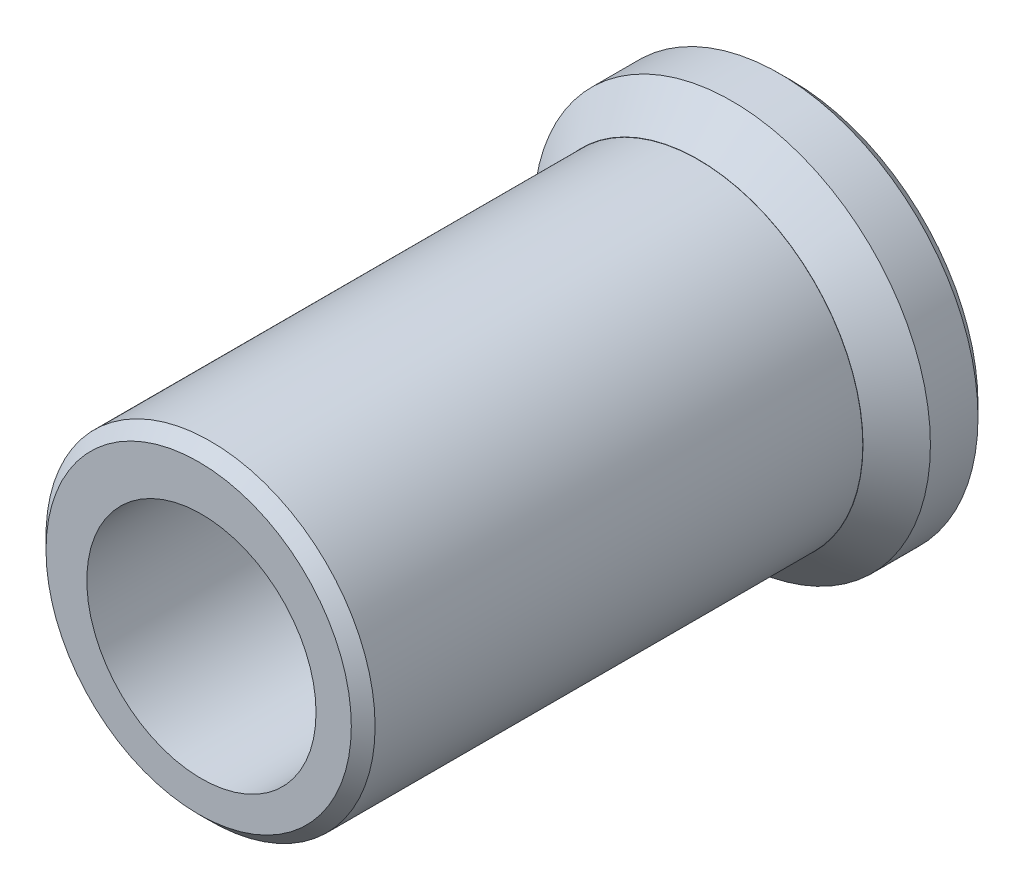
from build123d import *

# Parameters (mm, degrees)
SKETCH1_R               = 12.7127
BOSS_EXTRUDE4_DEPTH     = 5.969
SKETCH1_3_R             = 10.541
BOSS_EXTRUDE5_DEPTH     = 37.973
CHAMFER1_SIZE           = 0.762
CHAMFER7_SIZE           = 2.159
F_5_8_18_TAPPED_HOLE1_D = 14.68374
CHAMFER8_SIZE           = 1.27


with BuildPart() as part:
    # Sketch1 → Boss-Extrude4 (new body)
    with BuildSketch(Plane.XY):
        Circle(SKETCH1_R)
    extrude(amount=BOSS_EXTRUDE4_DEPTH)

    # Sketch1_3 → Boss-Extrude5 (add)
    with BuildSketch(Plane.XY):
        Circle(SKETCH1_3_R)
    extrude(amount=BOSS_EXTRUDE5_DEPTH)

    # Chamfer1
    chamfer1_edges = [part.edges().sort_by_distance(p)[0] for p in [
        (-12.7127, 0, 0),
        (-10.541, 0, 37.973),
    ]]
    chamfer(chamfer1_edges, length=CHAMFER1_SIZE)

    # Chamfer7
    chamfer7_edges = [part.edges().sort_by_distance(p)[0] for p in [
        (-12.7127, 0, 5.969),
    ]]
    chamfer(chamfer7_edges, length=CHAMFER7_SIZE)

    # 5_8-18 Tapped Hole1 (through all)
    with Locations(Plane.XY.offset(37.973)):
        with Locations((0.177502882, -0.373113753)):
            Hole(F_5_8_18_TAPPED_HOLE1_D / 2)

    # Chamfer8
    chamfer8_edges = [part.edges().sort_by_distance(p)[0] for p in [
        (7.519372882, -0.373113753, 0),
    ]]
    chamfer(chamfer8_edges, length=CHAMFER8_SIZE)


solid = part.part
